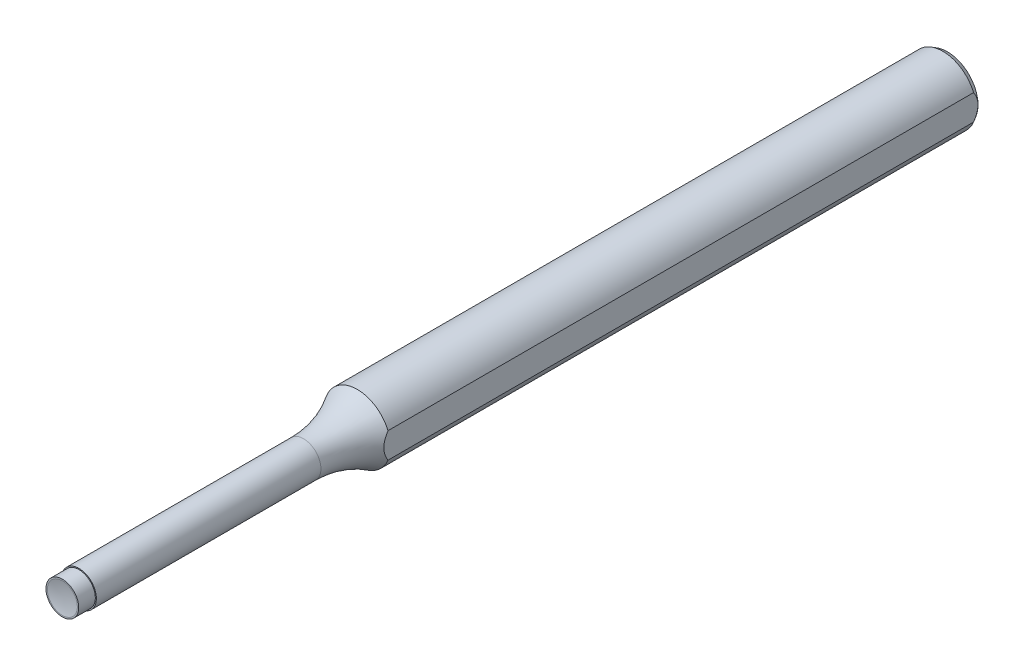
ISO-10303-21;
HEADER;
FILE_DESCRIPTION(('STEP AP214'),'2;1');
FILE_NAME('part.step','',(''),(''),'','','');
FILE_SCHEMA(('AUTOMOTIVE_DESIGN { 1 0 10303 214 1 1 1 1 }'));
ENDSEC;
DATA;
#1=APPLICATION_CONTEXT('core data for automotive mechanical design processes');
#2=APPLICATION_PROTOCOL_DEFINITION('international standard','automotive_design',2000,#1);
#3=PRODUCT_CONTEXT('',#1,'mechanical');
#4=PRODUCT('Part','Part','',(#3));
#5=PRODUCT_RELATED_PRODUCT_CATEGORY('part','',(#4));
#6=PRODUCT_DEFINITION_FORMATION('','',#4);
#7=PRODUCT_DEFINITION_CONTEXT('part definition',#1,'design');
#8=PRODUCT_DEFINITION('design','',#6,#7);
#9=PRODUCT_DEFINITION_SHAPE('','',#8);
#10=(LENGTH_UNIT() NAMED_UNIT(*) SI_UNIT(.MILLI.,.METRE.));
#11=(NAMED_UNIT(*) PLANE_ANGLE_UNIT() SI_UNIT($,.RADIAN.));
#12=(NAMED_UNIT(*) SI_UNIT($,.STERADIAN.) SOLID_ANGLE_UNIT());
#13=UNCERTAINTY_MEASURE_WITH_UNIT(LENGTH_MEASURE(1.E-05),#10,'distance_accuracy_value','');
#14=(GEOMETRIC_REPRESENTATION_CONTEXT(3) GLOBAL_UNCERTAINTY_ASSIGNED_CONTEXT((#13)) GLOBAL_UNIT_ASSIGNED_CONTEXT((#10,
#11,#12)) REPRESENTATION_CONTEXT('',''));
#15=CARTESIAN_POINT('',(0.,0.,0.));
#16=DIRECTION('',(0.,0.,1.));
#17=DIRECTION('',(1.,0.,0.));
#18=AXIS2_PLACEMENT_3D('',#15,#16,#17);
#19=CARTESIAN_POINT('',(0.,0.,-42.3333333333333));
#20=DIRECTION('',(0.,0.,1.));
#21=DIRECTION('',(1.,0.,0.));
#22=AXIS2_PLACEMENT_3D('',#19,#20,#21);
#23=CYLINDRICAL_SURFACE('',#22,2.5);
#24=CARTESIAN_POINT('',(0.,0.,-34.611537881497));
#25=DIRECTION('',(0.,0.,1.));
#26=DIRECTION('',(0.,-1.,0.));
#27=AXIS2_PLACEMENT_3D('',#24,#25,#26);
#28=CIRCLE('',#27,2.5);
#29=CARTESIAN_POINT('',(0.,-2.5,-34.611537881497));
#30=VERTEX_POINT('',#29);
#31=EDGE_CURVE('E79',#30,#30,#28,.F.);
#32=ORIENTED_EDGE('',*,*,#31,.F.);
#33=EDGE_LOOP('',(#32));
#34=FACE_BOUND('',#33,.T.);
#35=CARTESIAN_POINT('',(0.,0.,-2.3825));
#36=DIRECTION('',(0.,0.,1.));
#37=DIRECTION('',(1.,0.,0.));
#38=AXIS2_PLACEMENT_3D('',#35,#36,#37);
#39=CIRCLE('',#38,2.5);
#40=CARTESIAN_POINT('',(2.5,0.,-2.3825));
#41=VERTEX_POINT('',#40);
#42=EDGE_CURVE('E90',#41,#41,#39,.F.);
#43=ORIENTED_EDGE('',*,*,#42,.T.);
#44=EDGE_LOOP('',(#43));
#45=FACE_BOUND('',#44,.T.);
#46=ADVANCED_FACE('F42',(#34,#45),#23,.T.);
#47=CARTESIAN_POINT('',(0.,0.,-2.3825));
#48=DIRECTION('',(0.,0.,1.));
#49=DIRECTION('',(1.,0.,0.));
#50=AXIS2_PLACEMENT_3D('',#47,#48,#49);
#51=PLANE('',#50);
#52=ORIENTED_EDGE('',*,*,#42,.F.);
#53=EDGE_LOOP('',(#52));
#54=FACE_BOUND('',#53,.T.);
#55=CARTESIAN_POINT('',(0.,0.,-2.3825));
#56=DIRECTION('',(0.,0.,1.));
#57=DIRECTION('',(1.,0.,0.));
#58=AXIS2_PLACEMENT_3D('',#55,#56,#57);
#59=CIRCLE('',#58,2.35);
#60=CARTESIAN_POINT('',(2.35,0.,-2.3825));
#61=VERTEX_POINT('',#60);
#62=EDGE_CURVE('E97',#61,#61,#59,.T.);
#63=ORIENTED_EDGE('',*,*,#62,.F.);
#64=EDGE_LOOP('',(#63));
#65=FACE_BOUND('',#64,.T.);
#66=ADVANCED_FACE('F110',(#54,#65),#51,.T.);
#67=CARTESIAN_POINT('',(0.,0.,-2.3825));
#68=DIRECTION('',(0.,0.,1.));
#69=DIRECTION('',(1.,0.,0.));
#70=AXIS2_PLACEMENT_3D('',#67,#68,#69);
#71=CYLINDRICAL_SURFACE('',#70,2.35);
#72=ORIENTED_EDGE('',*,*,#62,.T.);
#73=EDGE_LOOP('',(#72));
#74=FACE_BOUND('',#73,.T.);
#75=CARTESIAN_POINT('',(0.,0.,0.));
#76=DIRECTION('',(0.,0.,1.));
#77=DIRECTION('',(1.,0.,0.));
#78=AXIS2_PLACEMENT_3D('',#75,#76,#77);
#79=CIRCLE('',#78,2.35);
#80=CARTESIAN_POINT('',(2.35,0.,0.));
#81=VERTEX_POINT('',#80);
#82=EDGE_CURVE('E122',#81,#81,#79,.T.);
#83=ORIENTED_EDGE('',*,*,#82,.F.);
#84=EDGE_LOOP('',(#83));
#85=FACE_BOUND('',#84,.T.);
#86=ADVANCED_FACE('F116',(#74,#85),#71,.T.);
#87=CARTESIAN_POINT('',(0.,0.,0.));
#88=DIRECTION('',(0.,0.,1.));
#89=DIRECTION('',(1.,0.,0.));
#90=AXIS2_PLACEMENT_3D('',#87,#88,#89);
#91=PLANE('',#90);
#92=CARTESIAN_POINT('',(0.,0.,0.));
#93=DIRECTION('',(0.,0.,1.));
#94=DIRECTION('',(0.,-1.,0.));
#95=AXIS2_PLACEMENT_3D('',#92,#93,#94);
#96=CIRCLE('',#95,2.15);
#97=CARTESIAN_POINT('',(0.,-2.15,0.));
#98=VERTEX_POINT('',#97);
#99=EDGE_CURVE('E126',#98,#98,#96,.T.);
#100=ORIENTED_EDGE('',*,*,#99,.F.);
#101=EDGE_LOOP('',(#100));
#102=FACE_BOUND('',#101,.T.);
#103=ORIENTED_EDGE('',*,*,#82,.T.);
#104=EDGE_LOOP('',(#103));
#105=FACE_BOUND('',#104,.T.);
#106=ADVANCED_FACE('F156',(#102,#105),#91,.T.);
#107=CARTESIAN_POINT('',(0.,0.,9.28430934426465));
#108=DIRECTION('',(0.,0.,1.));
#109=DIRECTION('',(0.,-1.,0.));
#110=AXIS2_PLACEMENT_3D('',#107,#108,#109);
#111=SPHERICAL_SURFACE('',#110,9.53);
#112=ORIENTED_EDGE('',*,*,#99,.T.);
#113=EDGE_LOOP('',(#112));
#114=FACE_BOUND('',#113,.T.);
#115=ADVANCED_FACE('F159',(#114),#111,.F.);
#116=CARTESIAN_POINT('',(0.,0.,-34.611537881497));
#117=DIRECTION('',(0.,0.,-1.));
#118=DIRECTION('',(0.,1.,0.));
#119=AXIS2_PLACEMENT_3D('',#116,#117,#118);
#120=TOROIDAL_SURFACE('',#119,16.795,14.295);
#121=CARTESIAN_POINT('',(4.39819012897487,10.3816848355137,-47.7977262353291));
#122=CARTESIAN_POINT('',(4.39819012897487,10.0921702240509,-47.6861631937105));
#123=CARTESIAN_POINT('',(4.39819012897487,9.80566725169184,-47.5669065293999));
#124=CARTESIAN_POINT('',(4.39819012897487,9.23917840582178,-47.3140947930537));
#125=CARTESIAN_POINT('',(4.39819012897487,8.95918983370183,-47.1805457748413));
#126=CARTESIAN_POINT('',(4.39819012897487,8.40739555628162,-46.9008604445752));
#127=CARTESIAN_POINT('',(4.39819012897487,8.13555528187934,-46.7547921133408));
#128=CARTESIAN_POINT('',(4.39819012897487,7.598654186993,-46.4506584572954));
#129=CARTESIAN_POINT('',(4.39819012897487,7.33359400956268,-46.2925920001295));
#130=CARTESIAN_POINT('',(4.39819012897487,6.81261720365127,-45.9673706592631));
#131=CARTESIAN_POINT('',(4.39819012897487,6.55663772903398,-45.8003160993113));
#132=CARTESIAN_POINT('',(4.39819012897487,6.05072135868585,-45.4572856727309));
#133=CARTESIAN_POINT('',(4.39819012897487,5.80078497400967,-45.2813090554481));
#134=CARTESIAN_POINT('',(4.39819012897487,5.30590715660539,-44.9221791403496));
#135=CARTESIAN_POINT('',(4.39819012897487,5.06096901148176,-44.7390213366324));
#136=CARTESIAN_POINT('',(4.39819012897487,4.5747105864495,-44.3679866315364));
#137=CARTESIAN_POINT('',(4.39819012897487,4.33339041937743,-44.180109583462));
#138=CARTESIAN_POINT('',(4.39819012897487,3.88055670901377,-43.8253352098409));
#139=CARTESIAN_POINT('',(4.39819012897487,3.66891361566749,-43.6586019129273));
#140=CARTESIAN_POINT('',(4.39819012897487,3.35002465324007,-43.4101178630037));
#141=CARTESIAN_POINT('',(4.39819012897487,3.24344141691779,-43.3275214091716));
#142=CARTESIAN_POINT('',(4.39819012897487,3.02937262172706,-43.1635092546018));
#143=CARTESIAN_POINT('',(4.39819012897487,2.92188709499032,-43.0820935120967));
#144=CARTESIAN_POINT('',(4.39819012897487,2.70595184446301,-42.9215707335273));
#145=CARTESIAN_POINT('',(4.39819012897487,2.59750867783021,-42.8424549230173));
#146=CARTESIAN_POINT('',(4.39819012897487,2.37849300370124,-42.6871533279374));
#147=CARTESIAN_POINT('',(4.39819012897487,2.26792004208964,-42.6109681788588));
#148=CARTESIAN_POINT('',(4.39819012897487,2.04409123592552,-42.4630827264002));
#149=CARTESIAN_POINT('',(4.39819012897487,1.93084086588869,-42.3913742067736));
#150=CARTESIAN_POINT('',(4.39819012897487,1.700621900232,-42.2542447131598));
#151=CARTESIAN_POINT('',(4.39819012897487,1.58365551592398,-42.1888200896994));
#152=CARTESIAN_POINT('',(4.39819012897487,1.37324045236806,-42.081294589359));
#153=CARTESIAN_POINT('',(4.39819012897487,1.28075123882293,-42.0373320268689));
#154=CARTESIAN_POINT('',(4.39819012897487,1.09278405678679,-41.9561780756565));
#155=CARTESIAN_POINT('',(4.39819012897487,0.99730556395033,-41.9189878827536));
#156=CARTESIAN_POINT('',(4.39819012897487,0.804074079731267,-41.8534376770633));
#157=CARTESIAN_POINT('',(4.39819012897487,0.706342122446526,-41.8250166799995));
#158=CARTESIAN_POINT('',(4.39819012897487,0.508443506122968,-41.7785093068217));
#159=CARTESIAN_POINT('',(4.39819012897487,0.408278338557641,-41.7604167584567));
#160=CARTESIAN_POINT('',(4.39819012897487,0.23069648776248,-41.7389218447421));
#161=CARTESIAN_POINT('',(4.39819012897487,0.153576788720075,-41.7330390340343));
#162=CARTESIAN_POINT('',(4.39819012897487,-0.000873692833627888,-41.7283736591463));
#163=CARTESIAN_POINT('',(4.39819012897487,-0.0782044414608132,-41.7295900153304));
#164=CARTESIAN_POINT('',(4.39819012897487,-0.232527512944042,-41.7390659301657));
#165=CARTESIAN_POINT('',(4.39819012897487,-0.309519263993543,-41.7473346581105));
#166=CARTESIAN_POINT('',(4.39819012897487,-0.462496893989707,-41.7704979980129));
#167=CARTESIAN_POINT('',(4.39819012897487,-0.538482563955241,-41.7853939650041));
#168=CARTESIAN_POINT('',(4.39819012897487,-0.717706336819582,-41.8279473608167));
#169=CARTESIAN_POINT('',(4.39819012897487,-0.820303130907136,-41.8583043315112));
#170=CARTESIAN_POINT('',(4.39819012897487,-1.02228546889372,-41.9282502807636));
#171=CARTESIAN_POINT('',(4.39819012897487,-1.12166903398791,-41.9678448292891));
#172=CARTESIAN_POINT('',(4.39819012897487,-1.31780242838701,-42.0544626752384));
#173=CARTESIAN_POINT('',(4.39819012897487,-1.41453340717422,-42.1015281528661));
#174=CARTESIAN_POINT('',(4.39819012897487,-1.55741089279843,-42.176252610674));
#175=CARTESIAN_POINT('',(4.39819012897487,-1.6046603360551,-42.2018445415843));
#176=CARTESIAN_POINT('',(4.39819012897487,-1.69848439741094,-42.2542305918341));
#177=CARTESIAN_POINT('',(4.39819012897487,-1.74505906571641,-42.2810246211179));
#178=CARTESIAN_POINT('',(4.39819012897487,-1.89307451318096,-42.3684014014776));
#179=CARTESIAN_POINT('',(4.39819012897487,-1.9933402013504,-42.4309756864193));
#180=CARTESIAN_POINT('',(4.39819012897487,-2.19152203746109,-42.55975436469));
#181=CARTESIAN_POINT('',(4.39819012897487,-2.28943754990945,-42.6259597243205));
#182=CARTESIAN_POINT('',(4.39819012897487,-2.48354419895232,-42.7610175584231));
#183=CARTESIAN_POINT('',(4.39819012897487,-2.5797337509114,-42.8298722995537));
#184=CARTESIAN_POINT('',(4.39819012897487,-2.7707873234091,-42.9694016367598));
#185=CARTESIAN_POINT('',(4.39819012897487,-2.86565125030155,-43.0400763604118));
#186=CARTESIAN_POINT('',(4.39819012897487,-3.14937383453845,-43.2542644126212));
#187=CARTESIAN_POINT('',(4.39819012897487,-3.33686252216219,-43.3995831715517));
#188=CARTESIAN_POINT('',(4.39819012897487,-3.71075538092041,-43.691612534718));
#189=CARTESIAN_POINT('',(4.39819012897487,-3.89715947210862,-43.8383232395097));
#190=CARTESIAN_POINT('',(4.39819012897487,-4.17714793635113,-44.0577102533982));
#191=CARTESIAN_POINT('',(4.39819012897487,-4.27049312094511,-44.1306887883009));
#192=CARTESIAN_POINT('',(4.39819012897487,-4.4574993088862,-44.276235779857));
#193=CARTESIAN_POINT('',(4.39819012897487,-4.55116030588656,-44.3488042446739));
#194=CARTESIAN_POINT('',(4.39819012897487,-4.83286364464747,-44.5656286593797));
#195=CARTESIAN_POINT('',(4.39819012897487,-5.02160241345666,-44.7089847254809));
#196=CARTESIAN_POINT('',(4.39819012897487,-5.40151768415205,-44.9918593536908));
#197=CARTESIAN_POINT('',(4.39819012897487,-5.59269022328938,-45.1313832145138));
#198=CARTESIAN_POINT('',(4.39819012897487,-5.97829954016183,-45.4058264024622));
#199=CARTESIAN_POINT('',(4.39819012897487,-6.17273614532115,-45.5407459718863));
#200=CARTESIAN_POINT('',(4.39819012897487,-6.68044967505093,-45.8827328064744));
#201=CARTESIAN_POINT('',(4.39819012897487,-6.99652348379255,-46.0856888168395));
#202=CARTESIAN_POINT('',(4.39819012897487,-7.63873314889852,-46.4752085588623));
#203=CARTESIAN_POINT('',(4.39819012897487,-7.96487108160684,-46.661768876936));
#204=CARTESIAN_POINT('',(4.39819012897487,-8.63349350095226,-47.0195298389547));
#205=CARTESIAN_POINT('',(4.39819012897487,-8.9761704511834,-47.1903734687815));
#206=CARTESIAN_POINT('',(4.39819012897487,-9.49767728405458,-47.4305232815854));
#207=CARTESIAN_POINT('',(4.39819012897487,-9.67281855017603,-47.5079094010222));
#208=CARTESIAN_POINT('',(4.39819012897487,-10.0254877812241,-47.6570771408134));
#209=CARTESIAN_POINT('',(4.39819012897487,-10.2030159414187,-47.7288582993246));
#210=CARTESIAN_POINT('',(4.39819012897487,-10.3816848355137,-47.7977262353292));
#211=B_SPLINE_CURVE_WITH_KNOTS('',3,(#121,#122,#123,#124,#125,#126,#127,#128,#129,#130,#131,
#132,#133,#134,#135,#136,#137,#138,#139,#140,#141,#142,#143,#144,#145,#146,#147,#148,#149,#150,
#151,#152,#153,#154,#155,#156,#157,#158,#159,#160,#161,#162,#163,#164,#165,#166,#167,#168,#169,
#170,#171,#172,#173,#174,#175,#176,#177,#178,#179,#180,#181,#182,#183,#184,#185,#186,#187,#188,
#189,#190,#191,#192,#193,#194,#195,#196,#197,#198,#199,#200,#201,#202,#203,#204,#205,#206,#207,
#208,#209,#210),.UNSPECIFIED.,.F.,.F.,(4,2,2,2,2,2,2,2,2,2,2,2,2,2,2,2,2,2,2,2,2,2,2,2,2,2,2,2,
2,2,2,2,2,2,2,2,2,2,2,2,2,2,2,2,4),(0.,0.930625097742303,1.8608575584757,2.78632503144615,
3.71187995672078,4.62866368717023,5.5455246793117,6.46297047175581,7.3804448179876,
8.18873628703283,8.59325564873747,8.99776066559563,9.40043668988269,9.80319954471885,
10.20520002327,10.60696560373,10.9139768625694,11.2210422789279,11.5259214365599,
11.8306182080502,12.0623431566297,12.2940328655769,12.52602427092,12.7580631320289,
13.0784658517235,13.3990622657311,13.721537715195,13.8827296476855,14.0439095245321,
14.3983547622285,14.7528947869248,15.1077451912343,15.4626205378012,16.1742180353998,
16.8858673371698,17.241327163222,17.5967798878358,18.3077767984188,19.0177353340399,
19.7276564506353,20.8540776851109,21.9807328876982,23.1286856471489,23.7030287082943,
24.2774190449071),.UNSPECIFIED.);
#212=CARTESIAN_POINT('',(4.39819012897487,1.83334355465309,-42.3333333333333));
#213=VERTEX_POINT('',#212);
#214=CARTESIAN_POINT('',(4.39819012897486,-1.83334355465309,-42.3333333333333));
#215=VERTEX_POINT('',#214);
#216=EDGE_CURVE('E58',#213,#215,#211,.T.);
#217=ORIENTED_EDGE('',*,*,#216,.F.);
#218=CARTESIAN_POINT('',(0.,0.,-42.3333333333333));
#219=DIRECTION('',(0.,0.,-1.));
#220=DIRECTION('',(0.,1.,0.));
#221=AXIS2_PLACEMENT_3D('',#218,#219,#220);
#222=CIRCLE('',#221,4.765);
#223=EDGE_CURVE('E131',#215,#213,#222,.T.);
#224=ORIENTED_EDGE('',*,*,#223,.F.);
#225=EDGE_LOOP('',(#217,#224));
#226=FACE_BOUND('',#225,.T.);
#227=ORIENTED_EDGE('',*,*,#31,.T.);
#228=EDGE_LOOP('',(#227));
#229=FACE_BOUND('',#228,.T.);
#230=ADVANCED_FACE('F106',(#226,#229),#120,.F.);
#231=CARTESIAN_POINT('',(0.,0.,-127.));
#232=DIRECTION('',(0.,0.,1.));
#233=DIRECTION('',(1.,0.,0.));
#234=AXIS2_PLACEMENT_3D('',#231,#232,#233);
#235=PLANE('',#234);
#236=CARTESIAN_POINT('',(0.,0.,-127.));
#237=DIRECTION('',(0.,0.,1.));
#238=DIRECTION('',(1.,0.,0.));
#239=AXIS2_PLACEMENT_3D('',#236,#237,#238);
#240=CIRCLE('',#239,4.39819012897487);
#241=CARTESIAN_POINT('',(4.39819012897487,0.,-127.));
#242=VERTEX_POINT('',#241);
#243=EDGE_CURVE('E85',#242,#242,#240,.F.);
#244=ORIENTED_EDGE('',*,*,#243,.T.);
#245=EDGE_LOOP('',(#244));
#246=FACE_BOUND('',#245,.T.);
#247=ADVANCED_FACE('F154',(#246),#235,.F.);
#248=CARTESIAN_POINT('',(0.,0.,-126.364666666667));
#249=DIRECTION('',(0.,0.,1.));
#250=DIRECTION('',(1.,0.,0.));
#251=AXIS2_PLACEMENT_3D('',#248,#249,#250);
#252=CONICAL_SURFACE('',#251,4.765,0.523598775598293);
#253=CARTESIAN_POINT('',(4.39819012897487,-5.33423797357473,-122.64314394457));
#254=CARTESIAN_POINT('',(4.39819012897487,-5.23964449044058,-122.769540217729));
#255=CARTESIAN_POINT('',(4.39819012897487,-5.14441079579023,-122.895461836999));
#256=CARTESIAN_POINT('',(4.39819012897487,-4.95244135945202,-123.14617446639));
#257=CARTESIAN_POINT('',(4.39819012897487,-4.85570546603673,-123.270965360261));
#258=CARTESIAN_POINT('',(4.39819012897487,-4.66025992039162,-123.519551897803));
#259=CARTESIAN_POINT('',(4.39819012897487,-4.56154555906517,-123.643343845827));
#260=CARTESIAN_POINT('',(4.39819012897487,-4.36213663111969,-123.889318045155));
#261=CARTESIAN_POINT('',(4.39819012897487,-4.26144213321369,-124.01150035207));
#262=CARTESIAN_POINT('',(4.39819012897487,-4.05667136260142,-124.255205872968));
#263=CARTESIAN_POINT('',(4.39819012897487,-3.95257064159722,-124.376708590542));
#264=CARTESIAN_POINT('',(4.39819012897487,-3.74160194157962,-124.617285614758));
#265=CARTESIAN_POINT('',(4.39819012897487,-3.63473408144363,-124.73636002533));
#266=CARTESIAN_POINT('',(4.39819012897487,-3.41782749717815,-124.971366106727));
#267=CARTESIAN_POINT('',(4.39819012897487,-3.30779217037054,-125.087300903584));
#268=CARTESIAN_POINT('',(4.39819012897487,-3.08382779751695,-125.315332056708));
#269=CARTESIAN_POINT('',(4.39819012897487,-2.96989944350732,-125.427429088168));
#270=CARTESIAN_POINT('',(4.39819012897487,-2.77186488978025,-125.614120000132));
#271=CARTESIAN_POINT('',(4.39819012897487,-2.68894403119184,-125.68996971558));
#272=CARTESIAN_POINT('',(4.39819012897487,-2.52044667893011,-125.838685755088));
#273=CARTESIAN_POINT('',(4.39819012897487,-2.43486999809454,-125.911551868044));
#274=CARTESIAN_POINT('',(4.39819012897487,-2.26054924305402,-126.053736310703));
#275=CARTESIAN_POINT('',(4.39819012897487,-2.17179979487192,-126.123048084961));
#276=CARTESIAN_POINT('',(4.39819012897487,-1.99088174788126,-126.257087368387));
#277=CARTESIAN_POINT('',(4.39819012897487,-1.89871312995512,-126.321814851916));
#278=CARTESIAN_POINT('',(4.39819012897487,-1.7090542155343,-126.446513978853));
#279=CARTESIAN_POINT('',(4.39819012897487,-1.61150226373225,-126.506392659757));
#280=CARTESIAN_POINT('',(4.39819012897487,-1.41210644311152,-126.618657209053));
#281=CARTESIAN_POINT('',(4.39819012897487,-1.31026180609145,-126.671041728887));
#282=CARTESIAN_POINT('',(4.39819012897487,-1.10269294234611,-126.766129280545));
#283=CARTESIAN_POINT('',(4.39819012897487,-0.996989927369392,-126.808878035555));
#284=CARTESIAN_POINT('',(4.39819012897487,-0.781614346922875,-126.882793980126));
#285=CARTESIAN_POINT('',(4.39819012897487,-0.67194529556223,-126.913971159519));
#286=CARTESIAN_POINT('',(4.39819012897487,-0.488020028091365,-126.954270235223));
#287=CARTESIAN_POINT('',(4.39819012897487,-0.414608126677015,-126.967290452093));
#288=CARTESIAN_POINT('',(4.39819012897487,-0.266950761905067,-126.987044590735));
#289=CARTESIAN_POINT('',(4.39819012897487,-0.192705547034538,-126.993780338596));
#290=CARTESIAN_POINT('',(4.39819012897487,-0.0439156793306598,-127.000708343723));
#291=CARTESIAN_POINT('',(4.39819012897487,0.0306289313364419,-127.000901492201));
#292=CARTESIAN_POINT('',(4.39819012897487,0.179435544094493,-126.994754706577));
#293=CARTESIAN_POINT('',(4.39819012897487,0.253697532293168,-126.988414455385));
#294=CARTESIAN_POINT('',(4.39819012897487,0.474629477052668,-126.959962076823));
#295=CARTESIAN_POINT('',(4.39819012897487,0.620159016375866,-126.928448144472));
#296=CARTESIAN_POINT('',(4.39819012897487,0.904823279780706,-126.844288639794));
#297=CARTESIAN_POINT('',(4.39819012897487,1.04395187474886,-126.791623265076));
#298=CARTESIAN_POINT('',(4.39819012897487,1.30222792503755,-126.675763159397));
#299=CARTESIAN_POINT('',(4.39819012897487,1.42203206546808,-126.61399704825));
#300=CARTESIAN_POINT('',(4.39819012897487,1.65585339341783,-126.480248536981));
#301=CARTESIAN_POINT('',(4.39819012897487,1.76986529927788,-126.40825703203));
#302=CARTESIAN_POINT('',(4.39819012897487,1.99362460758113,-126.255843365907));
#303=CARTESIAN_POINT('',(4.39819012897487,2.10332163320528,-126.175348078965));
#304=CARTESIAN_POINT('',(4.39819012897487,2.31795882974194,-126.008389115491));
#305=CARTESIAN_POINT('',(4.39819012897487,2.42290098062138,-125.921927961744));
#306=CARTESIAN_POINT('',(4.39819012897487,2.66383353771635,-125.714113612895));
#307=CARTESIAN_POINT('',(4.39819012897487,2.79822037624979,-125.590909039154));
#308=CARTESIAN_POINT('',(4.39819012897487,3.0611757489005,-125.338408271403));
#309=CARTESIAN_POINT('',(4.39819012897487,3.18974214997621,-125.209109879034));
#310=CARTESIAN_POINT('',(4.39819012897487,3.44236417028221,-124.945697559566));
#311=CARTESIAN_POINT('',(4.39819012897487,3.56641012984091,-124.811574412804));
#312=CARTESIAN_POINT('',(4.39819012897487,3.81058734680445,-124.539807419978));
#313=CARTESIAN_POINT('',(4.39819012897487,3.93071829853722,-124.402163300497));
#314=CARTESIAN_POINT('',(4.39819012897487,4.16130930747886,-124.131643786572));
#315=CARTESIAN_POINT('',(4.39819012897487,4.27194072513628,-123.998913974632));
#316=CARTESIAN_POINT('',(4.39819012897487,4.49075134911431,-123.731440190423));
#317=CARTESIAN_POINT('',(4.39819012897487,4.59893042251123,-123.59669610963));
#318=CARTESIAN_POINT('',(4.39819012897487,4.81265144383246,-123.326247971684));
#319=CARTESIAN_POINT('',(4.39819012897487,4.91820400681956,-123.190552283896));
#320=CARTESIAN_POINT('',(4.39819012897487,5.12750213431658,-122.917805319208));
#321=CARTESIAN_POINT('',(4.39819012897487,5.23124796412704,-122.780754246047));
#322=CARTESIAN_POINT('',(4.39819012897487,5.33423797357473,-122.64314394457));
#323=B_SPLINE_CURVE_WITH_KNOTS('',3,(#253,#254,#255,#256,#257,#258,#259,#260,#261,#262,#263,
#264,#265,#266,#267,#268,#269,#270,#271,#272,#273,#274,#275,#276,#277,#278,#279,#280,#281,#282,
#283,#284,#285,#286,#287,#288,#289,#290,#291,#292,#293,#294,#295,#296,#297,#298,#299,#300,#301,
#302,#303,#304,#305,#306,#307,#308,#309,#310,#311,#312,#313,#314,#315,#316,#317,#318,#319,#320,
#321,#322),.UNSPECIFIED.,.F.,.F.,(4,2,2,2,2,2,2,2,2,2,2,2,2,2,2,2,2,2,2,2,2,2,2,2,2,2,2,2,2,2,2,
2,2,2,4),(0.,0.473622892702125,0.947293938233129,1.42227179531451,1.89723319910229,
2.37719719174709,2.85714059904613,3.33658712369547,3.81594885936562,4.15302867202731,
4.49013229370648,4.82783680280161,5.16554320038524,5.50866767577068,5.85185381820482,
6.19337550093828,6.53460165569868,6.75803376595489,6.98140093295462,7.20473767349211,
7.42808525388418,7.87266697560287,8.31766589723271,8.72141386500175,9.12552361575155,
9.53344563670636,9.94119620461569,10.4878713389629,11.0347452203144,11.5827263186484,
12.1307500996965,12.6490872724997,13.1674524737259,13.6831809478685,14.1988330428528),.UNSPECIFIED.);
#324=CARTESIAN_POINT('',(4.39819012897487,-1.83334355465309,-126.364666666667));
#325=VERTEX_POINT('',#324);
#326=EDGE_CURVE('E73',#325,#242,#323,.T.);
#327=ORIENTED_EDGE('',*,*,#326,.F.);
#328=CARTESIAN_POINT('',(0.,0.,-126.364666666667));
#329=DIRECTION('',(0.,0.,1.));
#330=DIRECTION('',(1.,0.,0.));
#331=AXIS2_PLACEMENT_3D('',#328,#329,#330);
#332=CIRCLE('',#331,4.765);
#333=CARTESIAN_POINT('',(4.39819012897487,1.83334355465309,-126.364666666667));
#334=VERTEX_POINT('',#333);
#335=EDGE_CURVE('E83',#334,#325,#332,.T.);
#336=ORIENTED_EDGE('',*,*,#335,.F.);
#337=EDGE_CURVE('E64',#242,#334,#323,.T.);
#338=ORIENTED_EDGE('',*,*,#337,.F.);
#339=ORIENTED_EDGE('',*,*,#243,.F.);
#340=EDGE_LOOP('',(#327,#336,#338,#339));
#341=FACE_BOUND('',#340,.T.);
#342=ADVANCED_FACE('F44',(#341),#252,.T.);
#343=CARTESIAN_POINT('',(0.,0.,-127.));
#344=DIRECTION('',(0.,0.,1.));
#345=DIRECTION('',(1.,0.,0.));
#346=AXIS2_PLACEMENT_3D('',#343,#344,#345);
#347=CYLINDRICAL_SURFACE('',#346,4.765);
#348=DIRECTION('',(0.,0.,1.));
#349=VECTOR('',#348,1.);
#350=CARTESIAN_POINT('',(4.39819012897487,1.83334355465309,-127.));
#351=LINE('',#350,#349);
#352=EDGE_CURVE('E13',#334,#213,#351,.T.);
#353=ORIENTED_EDGE('',*,*,#352,.F.);
#354=ORIENTED_EDGE('',*,*,#335,.T.);
#355=DIRECTION('',(0.,0.,1.));
#356=VECTOR('',#355,1.);
#357=CARTESIAN_POINT('',(4.39819012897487,-1.83334355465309,-127.));
#358=LINE('',#357,#356);
#359=EDGE_CURVE('E52',#215,#325,#358,.F.);
#360=ORIENTED_EDGE('',*,*,#359,.F.);
#361=ORIENTED_EDGE('',*,*,#223,.T.);
#362=EDGE_LOOP('',(#353,#354,#360,#361));
#363=FACE_BOUND('',#362,.T.);
#364=ADVANCED_FACE('F88',(#363),#347,.T.);
#365=CARTESIAN_POINT('',(4.39819012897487,1.83334355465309,0.));
#366=DIRECTION('',(-1.,0.,0.));
#367=DIRECTION('',(0.,0.,1.));
#368=AXIS2_PLACEMENT_3D('',#365,#366,#367);
#369=PLANE('',#368);
#370=ORIENTED_EDGE('',*,*,#216,.T.);
#371=ORIENTED_EDGE('',*,*,#359,.T.);
#372=ORIENTED_EDGE('',*,*,#326,.T.);
#373=ORIENTED_EDGE('',*,*,#337,.T.);
#374=ORIENTED_EDGE('',*,*,#352,.T.);
#375=EDGE_LOOP('',(#370,#371,#372,#373,#374));
#376=FACE_BOUND('',#375,.T.);
#377=ADVANCED_FACE('F72',(#376),#369,.F.);
#378=CLOSED_SHELL('',(#46,#66,#86,#106,#115,#230,#247,#342,#364,#377));
#379=MANIFOLD_SOLID_BREP('B2',#378);
#380=ADVANCED_BREP_SHAPE_REPRESENTATION('',(#18,#379),#14);
#381=SHAPE_DEFINITION_REPRESENTATION(#9,#380);
ENDSEC;
END-ISO-10303-21;
